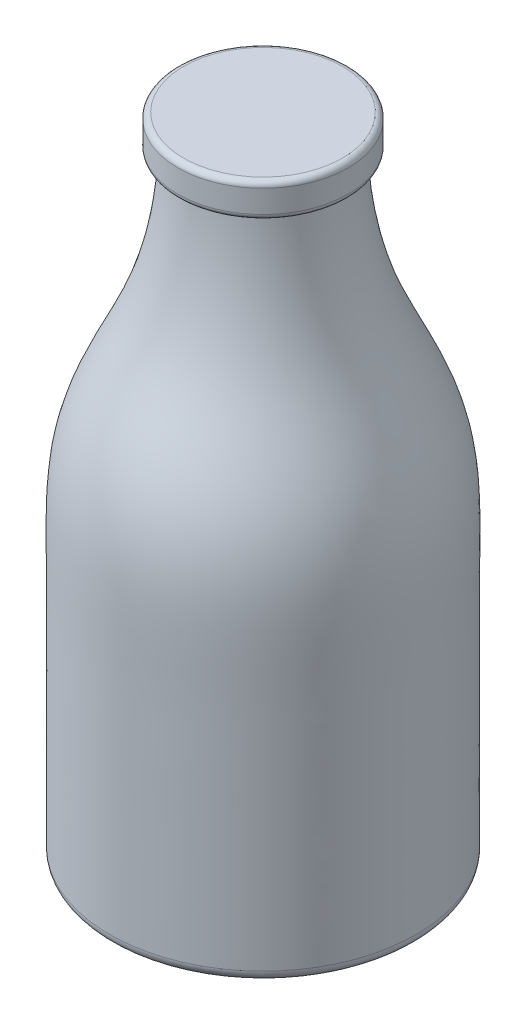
from build123d import *


with BuildPart() as part:
    # Sketch2 → Revolve2 (revolve)
    with BuildSketch(Plane.XY, mode=Mode.PRIVATE) as revolve2_sk:
        with BuildLine():
            Line((0, 0), (0, 108))
            Line((0, 108), (0, 114))
            Line((0, 114), (14, 114))
            ThreePointArc((14, 114), (14.707106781, 113.707106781), (15, 113))
            Line((15, 113), (15, 109))
            ThreePointArc((15, 109), (14.707106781, 108.292893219), (14, 108))
            Line((14, 108), (13.035181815, 108))
            add(Edge.make_bspline(
                [(13.035181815, 108), (13.328430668, 100.144153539), (15.226020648, 89.10466805), (21.47421333, 76.4118758), (25.195844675, 68.148442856), (26.752535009, 60.383271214), (27.099998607, 52.570863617), (26.961053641, 43.877421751), (27.004894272, 35.228633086), (26.994106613, 21.102638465), (27.008486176, 10.649104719), (27, 2)],
                knots=[0, 0, 0, 0, 0.21901973, 0.302893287, 0.391853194, 0.469303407, 0.520529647, 0.608456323, 0.710245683, 0.760264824, 1, 1, 1, 1], degree=3))
            ThreePointArc((27, 2), (26.414213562, 0.585786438), (25, 0))
            Line((25, 0), (0, 0))
        make_face()
    revolve(revolve2_sk.sketch.rotate(Axis((0, 0, 0), (0, 1, 0)), 90), axis=Axis((0, 0, 0), (0, 1, 0)))


solid = part.part
